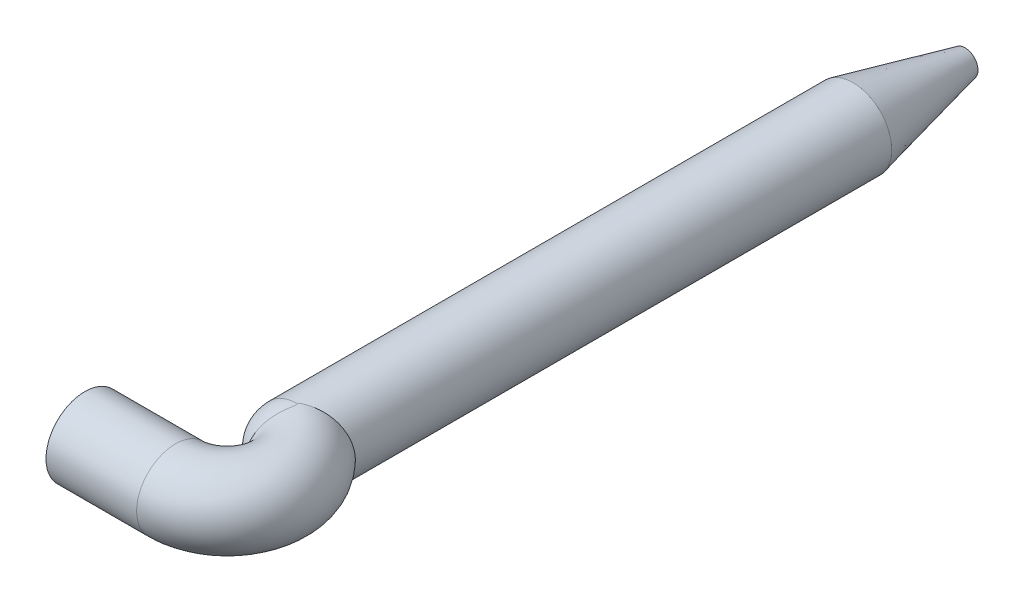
ISO-10303-21;
HEADER;
FILE_DESCRIPTION(('STEP AP214'),'2;1');
FILE_NAME('part.step','',(''),(''),'','','');
FILE_SCHEMA(('AUTOMOTIVE_DESIGN { 1 0 10303 214 1 1 1 1 }'));
ENDSEC;
DATA;
#1=APPLICATION_CONTEXT('core data for automotive mechanical design processes');
#2=APPLICATION_PROTOCOL_DEFINITION('international standard','automotive_design',2000,#1);
#3=PRODUCT_CONTEXT('',#1,'mechanical');
#4=PRODUCT('Part','Part','',(#3));
#5=PRODUCT_RELATED_PRODUCT_CATEGORY('part','',(#4));
#6=PRODUCT_DEFINITION_FORMATION('','',#4);
#7=PRODUCT_DEFINITION_CONTEXT('part definition',#1,'design');
#8=PRODUCT_DEFINITION('design','',#6,#7);
#9=PRODUCT_DEFINITION_SHAPE('','',#8);
#10=(LENGTH_UNIT() NAMED_UNIT(*) SI_UNIT(.MILLI.,.METRE.));
#11=(NAMED_UNIT(*) PLANE_ANGLE_UNIT() SI_UNIT($,.RADIAN.));
#12=(NAMED_UNIT(*) SI_UNIT($,.STERADIAN.) SOLID_ANGLE_UNIT());
#13=UNCERTAINTY_MEASURE_WITH_UNIT(LENGTH_MEASURE(1.E-05),#10,'distance_accuracy_value','');
#14=(GEOMETRIC_REPRESENTATION_CONTEXT(3) GLOBAL_UNCERTAINTY_ASSIGNED_CONTEXT((#13)) GLOBAL_UNIT_ASSIGNED_CONTEXT((#10,
#11,#12)) REPRESENTATION_CONTEXT('',''));
#15=CARTESIAN_POINT('',(0.,0.,0.));
#16=DIRECTION('',(0.,0.,1.));
#17=DIRECTION('',(1.,0.,0.));
#18=AXIS2_PLACEMENT_3D('',#15,#16,#17);
#19=CARTESIAN_POINT('',(-7.,-21.5,21.));
#20=DIRECTION('',(-1.,0.,0.));
#21=DIRECTION('',(0.,0.,1.));
#22=AXIS2_PLACEMENT_3D('',#19,#20,#21);
#23=PLANE('',#22);
#24=CARTESIAN_POINT('',(-7.,-21.5,21.));
#25=DIRECTION('',(-1.,0.,0.));
#26=DIRECTION('',(0.,0.,1.));
#27=AXIS2_PLACEMENT_3D('',#24,#25,#26);
#28=CIRCLE('',#27,3.);
#29=CARTESIAN_POINT('',(-7.,-21.5,24.));
#30=VERTEX_POINT('',#29);
#31=EDGE_CURVE('E143',#30,#30,#28,.F.);
#32=ORIENTED_EDGE('',*,*,#31,.F.);
#33=EDGE_LOOP('',(#32));
#34=FACE_BOUND('',#33,.T.);
#35=ADVANCED_FACE('F36',(#34),#23,.T.);
#36=CARTESIAN_POINT('',(-3.5,-21.5,21.));
#37=DIRECTION('',(-1.,0.,0.));
#38=DIRECTION('',(0.,0.,1.));
#39=AXIS2_PLACEMENT_3D('',#36,#37,#38);
#40=CYLINDRICAL_SURFACE('',#39,3.);
#41=ORIENTED_EDGE('',*,*,#31,.T.);
#42=EDGE_LOOP('',(#41));
#43=FACE_BOUND('',#42,.T.);
#44=CARTESIAN_POINT('',(0.,-21.5,21.));
#45=DIRECTION('',(-1.,0.,0.));
#46=DIRECTION('',(0.,0.,1.));
#47=AXIS2_PLACEMENT_3D('',#44,#45,#46);
#48=CIRCLE('',#47,3.);
#49=CARTESIAN_POINT('',(0.,-21.5,24.));
#50=VERTEX_POINT('',#49);
#51=EDGE_CURVE('E140',#50,#50,#48,.F.);
#52=ORIENTED_EDGE('',*,*,#51,.F.);
#53=EDGE_LOOP('',(#52));
#54=FACE_BOUND('',#53,.T.);
#55=ADVANCED_FACE('F106',(#43,#54),#40,.T.);
#56=CARTESIAN_POINT('',(0.,-21.5,17.));
#57=DIRECTION('',(0.,-1.,0.));
#58=DIRECTION('',(-0.866025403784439,0.,-0.5));
#59=AXIS2_PLACEMENT_3D('',#56,#57,#58);
#60=TOROIDAL_SURFACE('',#59,4.,3.);
#61=ORIENTED_EDGE('',*,*,#51,.T.);
#62=EDGE_LOOP('',(#61));
#63=FACE_BOUND('',#62,.T.);
#64=CARTESIAN_POINT('',(2.03666666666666,-24.4997759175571,13.6));
#65=CARTESIAN_POINT('',(2.03517029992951,-24.4997945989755,13.5973220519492));
#66=CARTESIAN_POINT('',(2.03367057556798,-24.4998121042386,13.5946459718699));
#67=CARTESIAN_POINT('',(2.03066312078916,-24.4998447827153,13.5892952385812));
#68=CARTESIAN_POINT('',(2.0291553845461,-24.4998599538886,13.5866205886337));
#69=CARTESIAN_POINT('',(2.02613190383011,-24.4998879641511,13.5812727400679));
#70=CARTESIAN_POINT('',(2.02461615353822,-24.499900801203,13.5785995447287));
#71=CARTESIAN_POINT('',(2.02157664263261,-24.4999241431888,13.5732546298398));
#72=CARTESIAN_POINT('',(2.02005287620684,-24.4999346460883,13.5705829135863));
#73=CARTESIAN_POINT('',(2.01699733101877,-24.4999533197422,13.5652409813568));
#74=CARTESIAN_POINT('',(2.01546554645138,-24.4999614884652,13.5625707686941));
#75=CARTESIAN_POINT('',(2.01239396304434,-24.4999754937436,13.5572318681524));
#76=CARTESIAN_POINT('',(2.01085415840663,-24.4999813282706,13.5545631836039));
#77=CARTESIAN_POINT('',(2.00776653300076,-24.4999906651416,13.5492273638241));
#78=CARTESIAN_POINT('',(2.00621870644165,-24.49999416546,13.5465602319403));
#79=CARTESIAN_POINT('',(2.00311503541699,-24.4999988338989,13.5412275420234));
#80=CARTESIAN_POINT('',(2.00155918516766,-24.4999999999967,13.5385619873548));
#81=CARTESIAN_POINT('',(2.,-24.5,13.5358983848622));
#82=B_SPLINE_CURVE_WITH_KNOTS('',3,(#64,#65,#66,#67,#68,#69,#70,#71,#72,#73,#74,#75,#76,#77,#78,
#79,#80,#81),.UNSPECIFIED.,.F.,.F.,(4,2,2,2,2,2,2,2,4),(0.,0.00920313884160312,
0.0184142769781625,0.0276334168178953,0.0368605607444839,0.046095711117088,0.0553388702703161,
0.0645900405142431,0.0738492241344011),.UNSPECIFIED.);
#83=CARTESIAN_POINT('',(2.,-24.5,13.5358983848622));
#84=VERTEX_POINT('',#83);
#85=CARTESIAN_POINT('',(2.03666666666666,-24.4997759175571,13.6));
#86=VERTEX_POINT('',#85);
#87=EDGE_CURVE('E82',#84,#86,#82,.F.);
#88=ORIENTED_EDGE('',*,*,#87,.F.);
#89=CARTESIAN_POINT('',(2.,-24.5,13.5358983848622));
#90=CARTESIAN_POINT('',(2.05506591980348,-24.5000014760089,13.5041037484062));
#91=CARTESIAN_POINT('',(2.11032116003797,-24.4984838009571,13.4726310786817));
#92=CARTESIAN_POINT('',(2.2220529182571,-24.4923009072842,13.4098082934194));
#93=CARTESIAN_POINT('',(2.27853338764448,-24.4875790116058,13.3784707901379));
#94=CARTESIAN_POINT('',(2.39252571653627,-24.4747632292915,13.316018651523));
#95=CARTESIAN_POINT('',(2.45003847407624,-24.4666122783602,13.2849173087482));
#96=CARTESIAN_POINT('',(2.5658738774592,-24.4467235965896,13.2230410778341));
#97=CARTESIAN_POINT('',(2.62419418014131,-24.4349287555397,13.1922801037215));
#98=CARTESIAN_POINT('',(2.74139235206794,-24.4075481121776,13.1311926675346));
#99=CARTESIAN_POINT('',(2.8002645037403,-24.3919054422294,13.1008807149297));
#100=CARTESIAN_POINT('',(2.91829039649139,-24.3566361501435,13.0407997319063));
#101=CARTESIAN_POINT('',(2.97743504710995,-24.3369531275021,13.0110457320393));
#102=CARTESIAN_POINT('',(3.06580453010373,-24.3044306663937,12.9670698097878));
#103=CARTESIAN_POINT('',(3.09536125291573,-24.2930205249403,12.9524434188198));
#104=CARTESIAN_POINT('',(3.1544239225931,-24.2691343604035,12.9233716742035));
#105=CARTESIAN_POINT('',(3.18392806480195,-24.2566514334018,12.9089283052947));
#106=CARTESIAN_POINT('',(3.24284080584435,-24.2306016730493,12.8802381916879));
#107=CARTESIAN_POINT('',(3.27224736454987,-24.2170279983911,12.8659934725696));
#108=CARTESIAN_POINT('',(3.33092004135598,-24.1887797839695,12.837715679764));
#109=CARTESIAN_POINT('',(3.36018389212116,-24.1740984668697,12.8236846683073));
#110=CARTESIAN_POINT('',(3.41852415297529,-24.1436197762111,12.795849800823));
#111=CARTESIAN_POINT('',(3.44759806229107,-24.1278156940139,12.7820480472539));
#112=CARTESIAN_POINT('',(3.50550994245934,-24.0950780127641,12.754687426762));
#113=CARTESIAN_POINT('',(3.53434517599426,-24.0781377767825,12.7411307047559));
#114=CARTESIAN_POINT('',(3.59172962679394,-24.0431162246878,12.7142761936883));
#115=CARTESIAN_POINT('',(3.62027586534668,-24.0250283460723,12.7009805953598));
#116=CARTESIAN_POINT('',(3.67703078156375,-23.9877019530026,12.6746646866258));
#117=CARTESIAN_POINT('',(3.7052362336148,-23.9684569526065,12.6616466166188));
#118=CARTESIAN_POINT('',(3.76125664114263,-23.9288089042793,12.6359024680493));
#119=CARTESIAN_POINT('',(3.78906811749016,-23.9083994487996,12.6231786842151));
#120=CARTESIAN_POINT('',(3.84424632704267,-23.8664173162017,12.5980401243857));
#121=CARTESIAN_POINT('',(3.87160931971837,-23.8448383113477,12.585627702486));
#122=CARTESIAN_POINT('',(3.92583515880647,-23.8005143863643,12.5611294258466));
#123=CARTESIAN_POINT('',(3.95269399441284,-23.7777632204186,12.5490459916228));
#124=CARTESIAN_POINT('',(4.00585486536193,-23.7310944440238,12.5252230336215));
#125=CARTESIAN_POINT('',(4.03215260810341,-23.7071706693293,12.5134859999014));
#126=CARTESIAN_POINT('',(4.08150990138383,-23.6606344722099,12.4915426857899));
#127=CARTESIAN_POINT('',(4.10463917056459,-23.6381144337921,12.4812971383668));
#128=CARTESIAN_POINT('',(4.15031983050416,-23.5921744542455,12.4611306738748));
#129=CARTESIAN_POINT('',(4.17286880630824,-23.5687515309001,12.4512110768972));
#130=CARTESIAN_POINT('',(4.21734760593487,-23.5210149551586,12.4317063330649));
#131=CARTESIAN_POINT('',(4.23927486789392,-23.4966983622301,12.4221225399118));
#132=CARTESIAN_POINT('',(4.2824694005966,-23.4471853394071,12.403299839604));
#133=CARTESIAN_POINT('',(4.30373395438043,-23.4219860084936,12.394062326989));
#134=CARTESIAN_POINT('',(4.34556210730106,-23.3707201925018,12.3759427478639));
#135=CARTESIAN_POINT('',(4.36612282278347,-23.3446508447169,12.3670621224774));
#136=CARTESIAN_POINT('',(4.40650247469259,-23.2916595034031,12.3496671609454));
#137=CARTESIAN_POINT('',(4.4263183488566,-23.2647346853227,12.3411543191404));
#138=CARTESIAN_POINT('',(4.46516767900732,-23.2100487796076,12.324506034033));
#139=CARTESIAN_POINT('',(4.48419788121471,-23.1822849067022,12.3163721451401));
#140=CARTESIAN_POINT('',(4.52143552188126,-23.125939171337,12.3004931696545));
#141=CARTESIAN_POINT('',(4.53963950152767,-23.0973545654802,12.2927497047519));
#142=CARTESIAN_POINT('',(4.57518474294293,-23.0393875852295,12.2776632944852));
#143=CARTESIAN_POINT('',(4.59252232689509,-23.0100025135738,12.2703220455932));
#144=CARTESIAN_POINT('',(4.62629531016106,-22.9504567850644,12.2560521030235));
#145=CARTESIAN_POINT('',(4.64272679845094,-22.9202934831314,12.2491251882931));
#146=CARTESIAN_POINT('',(4.67464874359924,-22.8592155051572,12.2356963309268));
#147=CARTESIAN_POINT('',(4.69013504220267,-22.8282982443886,12.2291962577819));
#148=CARTESIAN_POINT('',(4.72012838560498,-22.7657384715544,12.2166337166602));
#149=CARTESIAN_POINT('',(4.73463101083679,-22.7340934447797,12.2105732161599));
#150=CARTESIAN_POINT('',(4.76216252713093,-22.6711523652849,12.1990940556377));
#151=CARTESIAN_POINT('',(4.7752215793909,-22.6398719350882,12.1936620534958));
#152=CARTESIAN_POINT('',(4.80030388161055,-22.5768065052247,12.1832488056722));
#153=CARTESIAN_POINT('',(4.81232662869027,-22.545021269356,12.1782677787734));
#154=CARTESIAN_POINT('',(4.83531264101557,-22.4809799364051,12.168759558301));
#155=CARTESIAN_POINT('',(4.84627523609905,-22.4487235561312,12.1642326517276));
#156=CARTESIAN_POINT('',(4.86711884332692,-22.3837745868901,12.1556360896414));
#157=CARTESIAN_POINT('',(4.87699900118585,-22.3510816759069,12.1515667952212));
#158=CARTESIAN_POINT('',(4.89565707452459,-22.2852952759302,12.1438890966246));
#159=CARTESIAN_POINT('',(4.90443393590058,-22.2522014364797,12.1402811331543));
#160=CARTESIAN_POINT('',(4.92086630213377,-22.1856497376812,12.1335300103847));
#161=CARTESIAN_POINT('',(4.9285205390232,-22.1521915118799,12.1303873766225));
#162=CARTESIAN_POINT('',(4.94269012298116,-22.0849484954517,12.1245711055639));
#163=CARTESIAN_POINT('',(4.94920397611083,-22.0511633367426,12.1218980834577));
#164=CARTESIAN_POINT('',(4.96107689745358,-21.9833047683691,12.117025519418));
#165=CARTESIAN_POINT('',(4.96643423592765,-21.9492310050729,12.1148266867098));
#166=CARTESIAN_POINT('',(4.97597989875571,-21.8808343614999,12.1109072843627));
#167=CARTESIAN_POINT('',(4.98016625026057,-21.8465111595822,12.1091875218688));
#168=CARTESIAN_POINT('',(4.98735748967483,-21.7776555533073,12.106231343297));
#169=CARTESIAN_POINT('',(4.99036015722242,-21.7431228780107,12.1049958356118));
#170=CARTESIAN_POINT('',(4.99517314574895,-21.6738889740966,12.1030135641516));
#171=CARTESIAN_POINT('',(4.99698099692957,-21.6391875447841,12.1022678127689));
#172=CARTESIAN_POINT('',(4.99939603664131,-21.5696574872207,12.1012707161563));
#173=CARTESIAN_POINT('',(5.00000050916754,-21.5348287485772,12.1010204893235));
#174=CARTESIAN_POINT('',(4.99999999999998,-21.5,12.1010205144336));
#175=B_SPLINE_CURVE_WITH_KNOTS('',3,(#89,#90,#91,#92,#93,#94,#95,#96,#97,#98,#99,#100,#101,#102,
#103,#104,#105,#106,#107,#108,#109,#110,#111,#112,#113,#114,#115,#116,#117,#118,#119,#120,#121,
#122,#123,#124,#125,#126,#127,#128,#129,#130,#131,#132,#133,#134,#135,#136,#137,#138,#139,#140,
#141,#142,#143,#144,#145,#146,#147,#148,#149,#150,#151,#152,#153,#154,#155,#156,#157,#158,#159,
#160,#161,#162,#163,#164,#165,#166,#167,#168,#169,#170,#171,#172,#173,#174),.UNSPECIFIED.,.F.,
.F.,(4,2,2,2,2,2,2,2,2,2,2,2,2,2,2,2,2,2,2,2,2,2,2,2,2,2,2,2,2,2,2,2,2,2,2,2,2,2,2,2,2,2,4),(0.,
0.190742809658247,0.384950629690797,0.582526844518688,0.783371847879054,0.987385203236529,
1.19446809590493,1.29914267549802,1.40455019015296,1.51068000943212,1.6175221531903,
1.72506739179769,1.83330734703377,1.94223459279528,2.05184275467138,2.16212660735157,
2.27308216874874,2.38470678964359,2.49699923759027,2.59858751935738,2.7005462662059,
2.80287736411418,2.90558394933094,3.00867043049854,3.11214250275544,3.21600715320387,
3.32027265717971,3.42494856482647,3.53004567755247,3.63557601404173,3.74155276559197,
3.84451906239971,3.94753504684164,4.05061573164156,4.15377719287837,4.25703647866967,
4.36041150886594,4.46392096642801,4.56758418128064,4.67142100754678,4.77545169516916,
4.87969675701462,4.9841768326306),.UNSPECIFIED.);
#176=CARTESIAN_POINT('',(4.99999999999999,-21.5,12.1010205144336));
#177=VERTEX_POINT('',#176);
#178=EDGE_CURVE('E185',#177,#84,#175,.F.);
#179=ORIENTED_EDGE('',*,*,#178,.F.);
#180=CARTESIAN_POINT('',(4.99999999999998,-21.5,12.1010205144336));
#181=CARTESIAN_POINT('',(5.00000050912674,-21.4651738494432,12.1010204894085));
#182=CARTESIAN_POINT('',(4.99939609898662,-21.4303477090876,12.1012706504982));
#183=CARTESIAN_POINT('',(4.99698130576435,-21.3608223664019,12.1022675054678));
#184=CARTESIAN_POINT('',(4.99517362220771,-21.3261230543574,12.103013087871));
#185=CARTESIAN_POINT('',(4.99036105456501,-21.2568928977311,12.1049949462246));
#186=CARTESIAN_POINT('',(4.98735862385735,-21.222361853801,12.1062302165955));
#187=CARTESIAN_POINT('',(4.98016790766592,-21.1535090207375,12.1091858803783));
#188=CARTESIAN_POINT('',(4.97598182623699,-21.1191869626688,12.1109053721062));
#189=CARTESIAN_POINT('',(4.96643671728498,-21.0507921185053,12.114824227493));
#190=CARTESIAN_POINT('',(4.96107964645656,-21.0167190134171,12.1170227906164));
#191=CARTESIAN_POINT('',(4.94920723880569,-20.9488612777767,12.1218948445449));
#192=CARTESIAN_POINT('',(4.9426936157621,-20.9150762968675,12.1245676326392));
#193=CARTESIAN_POINT('',(4.92852443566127,-20.8478331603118,12.1303834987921));
#194=CARTESIAN_POINT('',(4.92087035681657,-20.8143746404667,12.133525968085));
#195=CARTESIAN_POINT('',(4.9044382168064,-20.7478218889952,12.140276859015));
#196=CARTESIAN_POINT('',(4.89566140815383,-20.7147272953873,12.1438847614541));
#197=CARTESIAN_POINT('',(4.87700331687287,-20.6489389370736,12.1515624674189));
#198=CARTESIAN_POINT('',(4.86712307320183,-20.6162448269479,12.1556318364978));
#199=CARTESIAN_POINT('',(4.84627914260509,-20.5512930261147,12.1642287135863));
#200=CARTESIAN_POINT('',(4.83531629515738,-20.5190350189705,12.168755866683));
#201=CARTESIAN_POINT('',(4.81232958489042,-20.4549900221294,12.1782647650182));
#202=CARTESIAN_POINT('',(4.80030637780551,-20.4232027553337,12.1832462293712));
#203=CARTESIAN_POINT('',(4.77522297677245,-20.3601328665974,12.1936606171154));
#204=CARTESIAN_POINT('',(4.76216327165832,-20.3288500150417,12.1990933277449));
#205=CARTESIAN_POINT('',(4.73463329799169,-20.2659110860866,12.2105726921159));
#206=CARTESIAN_POINT('',(4.72013309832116,-20.234270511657,12.2166325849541));
#207=CARTESIAN_POINT('',(4.69014434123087,-20.1717186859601,12.2291937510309));
#208=CARTESIAN_POINT('',(4.67466017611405,-20.1408049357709,12.2356930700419));
#209=CARTESIAN_POINT('',(4.64274221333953,-20.0797330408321,12.2491203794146));
#210=CARTESIAN_POINT('',(4.62631254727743,-20.0495723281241,12.2560465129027));
#211=CARTESIAN_POINT('',(4.59254285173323,-19.9900308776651,12.2703149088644));
#212=CARTESIAN_POINT('',(4.57520670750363,-19.9606475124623,12.2776554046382));
#213=CARTESIAN_POINT('',(4.53966393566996,-19.9026830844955,12.2927403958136));
#214=CARTESIAN_POINT('',(4.52146096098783,-19.8740993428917,12.3004832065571));
#215=CARTESIAN_POINT('',(4.48422486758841,-19.8177545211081,12.3163610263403));
#216=CARTESIAN_POINT('',(4.46519518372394,-19.7899907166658,12.3244944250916));
#217=CARTESIAN_POINT('',(4.42634638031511,-19.7353041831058,12.3411419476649));
#218=CARTESIAN_POINT('',(4.40653049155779,-19.7083786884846,12.3496545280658));
#219=CARTESIAN_POINT('',(4.36615025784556,-19.6553852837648,12.3670492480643));
#220=CARTESIAN_POINT('',(4.3455889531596,-19.6293145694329,12.3759299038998));
#221=CARTESIAN_POINT('',(4.30375903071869,-19.5780453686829,12.3940498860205));
#222=CARTESIAN_POINT('',(4.28249327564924,-19.552844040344,12.4032877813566));
#223=CARTESIAN_POINT('',(4.23929571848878,-19.5033264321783,12.4221116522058));
#224=CARTESIAN_POINT('',(4.21736661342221,-19.4790072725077,12.4316962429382));
#225=CARTESIAN_POINT('',(4.17288346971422,-19.4312650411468,12.4512030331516));
#226=CARTESIAN_POINT('',(4.15033197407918,-19.4078390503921,12.4611238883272));
#227=CARTESIAN_POINT('',(4.10464562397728,-19.3618924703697,12.4812934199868));
#228=CARTESIAN_POINT('',(4.08151316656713,-19.3393689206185,12.4915407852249));
#229=CARTESIAN_POINT('',(4.03215368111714,-19.2928299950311,12.5134860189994));
#230=CARTESIAN_POINT('',(4.00585705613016,-19.2689068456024,12.5252230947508));
#231=CARTESIAN_POINT('',(3.95269831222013,-19.2222392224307,12.5490460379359));
#232=CARTESIAN_POINT('',(3.92584048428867,-19.1994885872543,12.5611294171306));
#233=CARTESIAN_POINT('',(3.87161658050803,-19.1551656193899,12.5856275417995));
#234=CARTESIAN_POINT('',(3.84425451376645,-19.1335870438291,12.5980398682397));
#235=CARTESIAN_POINT('',(3.78907806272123,-19.0916056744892,12.6231781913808));
#236=CARTESIAN_POINT('',(3.76126741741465,-19.0711965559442,12.6359018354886));
#237=CARTESIAN_POINT('',(3.7052485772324,-19.0315490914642,12.6616456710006));
#238=CARTESIAN_POINT('',(3.67704386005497,-19.0123043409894,12.6746635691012));
#239=CARTESIAN_POINT('',(3.62029031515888,-18.9749783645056,12.7009791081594));
#240=CARTESIAN_POINT('',(3.591744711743,-18.9568906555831,12.7142745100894));
#241=CARTESIAN_POINT('',(3.5343614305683,-18.9218693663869,12.7411286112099));
#242=CARTESIAN_POINT('',(3.50552673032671,-18.9049292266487,12.7546851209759));
#243=CARTESIAN_POINT('',(3.44761581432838,-18.8721916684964,12.7820453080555));
#244=CARTESIAN_POINT('',(3.41854233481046,-18.8563876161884,12.7958468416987));
#245=CARTESIAN_POINT('',(3.36020283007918,-18.8259089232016,12.8236812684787));
#246=CARTESIAN_POINT('',(3.33093930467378,-18.8112275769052,12.8377120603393));
#247=CARTESIAN_POINT('',(3.27226717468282,-18.7829792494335,12.8659894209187));
#248=CARTESIAN_POINT('',(3.24286083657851,-18.7694054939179,12.8802339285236));
#249=CARTESIAN_POINT('',(3.1839484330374,-18.7433555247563,12.9089236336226));
#250=CARTESIAN_POINT('',(3.15444440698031,-18.7308724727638,12.9233668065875));
#251=CARTESIAN_POINT('',(3.09538186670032,-18.7069860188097,12.9524381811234));
#252=CARTESIAN_POINT('',(3.06582515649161,-18.6955757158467,12.9670643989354));
#253=CARTESIAN_POINT('',(2.97745542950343,-18.6630526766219,13.0110399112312));
#254=CARTESIAN_POINT('',(2.91831049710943,-18.6433692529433,13.0407936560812));
#255=CARTESIAN_POINT('',(2.80028365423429,-18.6080990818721,13.1008742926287));
#256=CARTESIAN_POINT('',(2.74141083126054,-18.5924559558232,13.1311861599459));
#257=CARTESIAN_POINT('',(2.62421095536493,-18.5650743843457,13.1922736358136));
#258=CARTESIAN_POINT('',(2.56588961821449,-18.5532790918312,13.2230347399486));
#259=CARTESIAN_POINT('',(2.45005181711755,-18.5333895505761,13.2849114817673));
#260=CARTESIAN_POINT('',(2.39253769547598,-18.5252382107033,13.316013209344));
#261=CARTESIAN_POINT('',(2.27854234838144,-18.5124217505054,13.3784664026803));
#262=CARTESIAN_POINT('',(2.22206022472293,-18.507699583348,13.4098045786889));
#263=CARTESIAN_POINT('',(2.1103249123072,-18.5015163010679,13.4726290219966));
#264=CARTESIAN_POINT('',(2.0550677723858,-18.4999985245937,13.5041026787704));
#265=CARTESIAN_POINT('',(2.,-18.5,13.5358983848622));
#266=B_SPLINE_CURVE_WITH_KNOTS('',3,(#180,#181,#182,#183,#184,#185,#186,#187,#188,#189,#190,
#191,#192,#193,#194,#195,#196,#197,#198,#199,#200,#201,#202,#203,#204,#205,#206,#207,#208,#209,
#210,#211,#212,#213,#214,#215,#216,#217,#218,#219,#220,#221,#222,#223,#224,#225,#226,#227,#228,
#229,#230,#231,#232,#233,#234,#235,#236,#237,#238,#239,#240,#241,#242,#243,#244,#245,#246,#247,
#248,#249,#250,#251,#252,#253,#254,#255,#256,#257,#258,#259,#260,#261,#262,#263,#264,#265),
.UNSPECIFIED.,.F.,.F.,(4,2,2,2,2,2,2,2,2,2,2,2,2,2,2,2,2,2,2,2,2,2,2,2,2,2,2,2,2,2,2,2,2,2,2,2,
2,2,2,2,2,2,4),(0.,0.10447228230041,0.208710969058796,0.312736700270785,0.416569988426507,
0.520231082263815,0.623739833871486,0.727115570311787,0.830376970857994,0.933541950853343,
1.03662755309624,1.13964984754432,1.24262384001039,1.34858533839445,1.45410319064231,
1.55919059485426,1.66385957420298,1.76812093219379,1.871984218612,1.97545770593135,
2.07854837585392,2.18126191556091,2.28360272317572,2.38557392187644,2.48717738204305,
2.59946631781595,2.71108773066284,2.82204039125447,2.93232165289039,3.04192753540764,
3.15085281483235,3.25909111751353,3.36663501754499,3.47347613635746,3.57960524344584,
3.68501235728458,3.7896868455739,3.99677047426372,4.20078577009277,4.40163388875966,
4.59921435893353,4.79342753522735,4.98417675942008),.UNSPECIFIED.);
#267=CARTESIAN_POINT('',(2.,-18.5,13.5358983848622));
#268=VERTEX_POINT('',#267);
#269=EDGE_CURVE('E53',#268,#177,#266,.F.);
#270=ORIENTED_EDGE('',*,*,#269,.F.);
#271=CARTESIAN_POINT('',(2.,-18.5,13.5358983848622));
#272=CARTESIAN_POINT('',(2.00155918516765,-18.5000000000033,13.5385619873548));
#273=CARTESIAN_POINT('',(2.00311503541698,-18.5000011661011,13.5412275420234));
#274=CARTESIAN_POINT('',(2.00621870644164,-18.50000583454,13.5465602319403));
#275=CARTESIAN_POINT('',(2.00776653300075,-18.5000093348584,13.5492273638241));
#276=CARTESIAN_POINT('',(2.01085415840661,-18.5000186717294,13.5545631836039));
#277=CARTESIAN_POINT('',(2.01239396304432,-18.5000245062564,13.5572318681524));
#278=CARTESIAN_POINT('',(2.01546554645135,-18.5000385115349,13.5625707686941));
#279=CARTESIAN_POINT('',(2.01699733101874,-18.5000466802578,13.5652409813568));
#280=CARTESIAN_POINT('',(2.02005287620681,-18.5000653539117,13.5705829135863));
#281=CARTESIAN_POINT('',(2.02157664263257,-18.5000758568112,13.5732546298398));
#282=CARTESIAN_POINT('',(2.02461615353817,-18.500099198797,13.5785995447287));
#283=CARTESIAN_POINT('',(2.02613190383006,-18.5001120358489,13.5812727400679));
#284=CARTESIAN_POINT('',(2.02915538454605,-18.5001400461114,13.5866205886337));
#285=CARTESIAN_POINT('',(2.0306631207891,-18.5001552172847,13.5892952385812));
#286=CARTESIAN_POINT('',(2.03367057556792,-18.5001878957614,13.5946459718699));
#287=CARTESIAN_POINT('',(2.03517029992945,-18.5002054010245,13.5973220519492));
#288=CARTESIAN_POINT('',(2.03666666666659,-18.5002240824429,13.6));
#289=B_SPLINE_CURVE_WITH_KNOTS('',3,(#271,#272,#273,#274,#275,#276,#277,#278,#279,#280,#281,
#282,#283,#284,#285,#286,#287,#288),.UNSPECIFIED.,.F.,.F.,(4,2,2,2,2,2,2,2,4),(0.,
0.00925918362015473,0.0185103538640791,0.0277535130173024,0.0369886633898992,0.0462158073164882,
0.0554349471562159,0.0646460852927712,0.073849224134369),.UNSPECIFIED.);
#290=CARTESIAN_POINT('',(2.03666666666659,-18.5002240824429,13.6));
#291=VERTEX_POINT('',#290);
#292=EDGE_CURVE('E87',#291,#268,#289,.F.);
#293=ORIENTED_EDGE('',*,*,#292,.F.);
#294=CARTESIAN_POINT('',(0.732263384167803,-21.4999999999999,16.3189784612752));
#295=CARTESIAN_POINT('',(0.7322637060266,-21.4677858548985,16.31897883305));
#296=CARTESIAN_POINT('',(0.732580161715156,-21.4355717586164,16.3185536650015));
#297=CARTESIAN_POINT('',(0.733841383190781,-21.3710823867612,16.3168485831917));
#298=CARTESIAN_POINT('',(0.734788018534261,-21.3388072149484,16.3155661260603));
#299=CARTESIAN_POINT('',(0.737310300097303,-21.2742058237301,16.3121363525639));
#300=CARTESIAN_POINT('',(0.738888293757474,-21.2418798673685,16.3099858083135));
#301=CARTESIAN_POINT('',(0.742674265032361,-21.1771879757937,16.3048078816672));
#302=CARTESIAN_POINT('',(0.744885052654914,-21.1448225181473,16.3017765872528));
#303=CARTESIAN_POINT('',(0.74993828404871,-21.0800639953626,16.2948231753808));
#304=CARTESIAN_POINT('',(0.752783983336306,-21.0476716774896,16.2908964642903));
#305=CARTESIAN_POINT('',(0.759109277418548,-20.9828734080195,16.2821363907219));
#306=CARTESIAN_POINT('',(0.762592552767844,-20.9504685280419,16.2772977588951));
#307=CARTESIAN_POINT('',(0.770195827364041,-20.8856610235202,16.2666962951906));
#308=CARTESIAN_POINT('',(0.774319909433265,-20.8532598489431,16.2609275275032));
#309=CARTESIAN_POINT('',(0.783208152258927,-20.7884778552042,16.2484466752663));
#310=CARTESIAN_POINT('',(0.787976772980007,-20.7560989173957,16.2417280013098));
#311=CARTESIAN_POINT('',(0.798158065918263,-20.6913820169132,16.2273269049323));
#312=CARTESIAN_POINT('',(0.803575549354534,-20.6590464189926,16.2196372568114));
#313=CARTESIAN_POINT('',(0.815058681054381,-20.5944395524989,16.2032724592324));
#314=CARTESIAN_POINT('',(0.821129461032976,-20.5621711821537,16.1945894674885));
#315=CARTESIAN_POINT('',(0.833925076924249,-20.4977253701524,16.1762160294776));
#316=CARTESIAN_POINT('',(0.840655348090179,-20.4655514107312,16.1665171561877));
#317=CARTESIAN_POINT('',(0.854771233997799,-20.4013235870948,16.1460867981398));
#318=CARTESIAN_POINT('',(0.862162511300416,-20.3692738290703,16.1353463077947));
#319=CARTESIAN_POINT('',(0.876424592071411,-20.3102789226,16.1145607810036));
#320=CARTESIAN_POINT('',(0.883214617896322,-20.2832696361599,16.1046419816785));
#321=CARTESIAN_POINT('',(0.897359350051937,-20.2290893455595,16.0839240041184));
#322=CARTESIAN_POINT('',(0.904722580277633,-20.2019257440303,16.0731112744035));
#323=CARTESIAN_POINT('',(0.920014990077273,-20.1474707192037,16.0505595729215));
#324=CARTESIAN_POINT('',(0.927952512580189,-20.1201874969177,16.0388064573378));
#325=CARTESIAN_POINT('',(0.944399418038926,-20.0655314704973,16.0143302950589));
#326=CARTESIAN_POINT('',(0.952917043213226,-20.0381677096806,16.0015925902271));
#327=CARTESIAN_POINT('',(0.970528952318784,-19.9833933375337,15.9751034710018));
#328=CARTESIAN_POINT('',(0.979631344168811,-19.9559926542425,15.9613369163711));
#329=CARTESIAN_POINT('',(0.998418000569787,-19.9011918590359,15.9327473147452));
#330=CARTESIAN_POINT('',(1.0081102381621,-19.8738026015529,15.9179086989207));
#331=CARTESIAN_POINT('',(1.02808173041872,-19.8190769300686,15.8871333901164));
#332=CARTESIAN_POINT('',(1.0383688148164,-19.7917523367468,15.8711807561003));
#333=CARTESIAN_POINT('',(1.05953514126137,-19.7372132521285,15.8381375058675));
#334=CARTESIAN_POINT('',(1.07042206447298,-19.7100115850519,15.8210306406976));
#335=CARTESIAN_POINT('',(1.09279311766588,-19.6557807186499,15.7856411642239));
#336=CARTESIAN_POINT('',(1.10428477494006,-19.6287653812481,15.767342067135));
#337=CARTESIAN_POINT('',(1.12787019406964,-19.5749746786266,15.729532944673));
#338=CARTESIAN_POINT('',(1.13997132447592,-19.548214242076,15.7100062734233));
#339=CARTESIAN_POINT('',(1.16478040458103,-19.4950061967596,15.6697101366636));
#340=CARTESIAN_POINT('',(1.17749556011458,-19.4685746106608,15.6489239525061));
#341=CARTESIAN_POINT('',(1.20353702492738,-19.4161018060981,15.6060799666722));
#342=CARTESIAN_POINT('',(1.21687037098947,-19.3900777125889,15.5840054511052));
#343=CARTESIAN_POINT('',(1.24086540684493,-19.3447185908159,15.5440380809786));
#344=CARTESIAN_POINT('',(1.25145536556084,-19.3251927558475,15.5263181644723));
#345=CARTESIAN_POINT('',(1.2734051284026,-19.2856802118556,15.4893770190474));
#346=CARTESIAN_POINT('',(1.28477539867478,-19.2657265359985,15.47012664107));
#347=CARTESIAN_POINT('',(1.30829111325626,-19.2254691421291,15.430038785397));
#348=CARTESIAN_POINT('',(1.32044609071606,-19.2052013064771,15.409170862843));
#349=CARTESIAN_POINT('',(1.34553784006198,-19.1644382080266,15.3657648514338));
#350=CARTESIAN_POINT('',(1.35848341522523,-19.1439818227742,15.3431953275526));
#351=CARTESIAN_POINT('',(1.38515753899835,-19.1029765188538,15.2963045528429));
#352=CARTESIAN_POINT('',(1.39889401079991,-19.0824696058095,15.2719510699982));
#353=CARTESIAN_POINT('',(1.4271699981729,-19.0415126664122,15.2214252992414));
#354=CARTESIAN_POINT('',(1.44171754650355,-19.0211079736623,15.1952207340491));
#355=CARTESIAN_POINT('',(1.46978919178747,-18.9829179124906,15.1441156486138));
#356=CARTESIAN_POINT('',(1.48330545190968,-18.965052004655,15.1192709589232));
#357=CARTESIAN_POINT('',(1.51039760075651,-18.9302250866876,15.068900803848));
#358=CARTESIAN_POINT('',(1.5239735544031,-18.9132659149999,15.0433741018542));
#359=CARTESIAN_POINT('',(1.55119693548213,-18.8802825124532,14.9916836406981));
#360=CARTESIAN_POINT('',(1.56484444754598,-18.8642600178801,14.9655188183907));
#361=CARTESIAN_POINT('',(1.59220813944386,-18.8331770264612,14.9125897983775));
#362=CARTESIAN_POINT('',(1.60592439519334,-18.8181181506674,14.8858246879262));
#363=CARTESIAN_POINT('',(1.63341081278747,-18.7889870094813,14.8317285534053));
#364=CARTESIAN_POINT('',(1.64718102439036,-18.7749162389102,14.8043967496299));
#365=CARTESIAN_POINT('',(1.67482295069,-18.7477890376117,14.7492310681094));
#366=CARTESIAN_POINT('',(1.68869477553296,-18.7347339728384,14.7213965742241));
#367=CARTESIAN_POINT('',(1.71800503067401,-18.7081437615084,14.6618129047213));
#368=CARTESIAN_POINT('',(1.73342996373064,-18.6947416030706,14.6299975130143));
#369=CARTESIAN_POINT('',(1.76320938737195,-18.6698115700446,14.5670928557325));
#370=CARTESIAN_POINT('',(1.777580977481,-18.6582268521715,14.5360342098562));
#371=CARTESIAN_POINT('',(1.80530411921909,-18.6367832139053,14.4747965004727));
#372=CARTESIAN_POINT('',(1.81867195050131,-18.6268689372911,14.4446441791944));
#373=CARTESIAN_POINT('',(1.84436594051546,-18.608612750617,14.3853214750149));
#374=CARTESIAN_POINT('',(1.85671100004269,-18.6002174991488,14.3561757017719));
#375=CARTESIAN_POINT('',(1.88035792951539,-18.5848492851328,14.2989606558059));
#376=CARTESIAN_POINT('',(1.89168071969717,-18.5778251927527,14.2709137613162));
#377=CARTESIAN_POINT('',(1.91327463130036,-18.5650521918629,14.2159720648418));
#378=CARTESIAN_POINT('',(1.92356942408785,-18.5592546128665,14.1890979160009));
#379=CARTESIAN_POINT('',(1.94179217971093,-18.5494993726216,14.1401157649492));
#380=CARTESIAN_POINT('',(1.94980017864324,-18.5454009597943,14.118065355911));
#381=CARTESIAN_POINT('',(1.9673025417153,-18.5368281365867,14.0684173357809));
#382=CARTESIAN_POINT('',(1.9766929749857,-18.532499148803,14.0407572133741));
#383=CARTESIAN_POINT('',(1.98982880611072,-18.526765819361,13.9999543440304));
#384=CARTESIAN_POINT('',(1.9939061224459,-18.5250360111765,13.9869631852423));
#385=CARTESIAN_POINT('',(2.00164969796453,-18.5218375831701,13.9615464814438));
#386=CARTESIAN_POINT('',(2.00532631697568,-18.5203602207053,13.94912519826));
#387=CARTESIAN_POINT('',(2.01467928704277,-18.5166950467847,13.9164242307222));
#388=CARTESIAN_POINT('',(2.02017219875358,-18.5146390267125,13.8960765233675));
#389=CARTESIAN_POINT('',(2.0298641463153,-18.5111288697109,13.8571426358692));
#390=CARTESIAN_POINT('',(2.0341371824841,-18.5096355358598,13.8385787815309));
#391=CARTESIAN_POINT('',(2.03971270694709,-18.5077028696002,13.8113243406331));
#392=CARTESIAN_POINT('',(2.04137313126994,-18.5071298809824,13.8027162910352));
#393=CARTESIAN_POINT('',(2.04437424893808,-18.5060857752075,13.7859491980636));
#394=CARTESIAN_POINT('',(2.04572782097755,-18.5056106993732,13.7777927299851));
#395=CARTESIAN_POINT('',(2.04811424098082,-18.504749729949,13.7619302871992));
#396=CARTESIAN_POINT('',(2.04916147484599,-18.5043601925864,13.7542266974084));
#397=CARTESIAN_POINT('',(2.05093347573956,-18.5036584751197,13.7392710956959));
#398=CARTESIAN_POINT('',(2.05167439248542,-18.5033429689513,13.7320211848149));
#399=CARTESIAN_POINT('',(2.05283191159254,-18.5027783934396,13.7179738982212));
#400=CARTESIAN_POINT('',(2.05326666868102,-18.5025263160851,13.7111781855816));
#401=CARTESIAN_POINT('',(2.05380964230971,-18.5020785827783,13.6980405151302));
#402=CARTESIAN_POINT('',(2.05393828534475,-18.501880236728,13.6916995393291));
#403=CARTESIAN_POINT('',(2.05386674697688,-18.5015308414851,13.6794716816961));
#404=CARTESIAN_POINT('',(2.05368948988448,-18.5013774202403,13.6735848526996));
#405=CARTESIAN_POINT('',(2.05316462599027,-18.5011727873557,13.6649353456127));
#406=CARTESIAN_POINT('',(2.05295638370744,-18.5011103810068,13.6621642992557));
#407=CARTESIAN_POINT('',(2.05245970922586,-18.5009941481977,13.6567364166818));
#408=CARTESIAN_POINT('',(2.05217466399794,-18.5009400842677,13.6540792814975));
#409=CARTESIAN_POINT('',(2.05152429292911,-18.5008396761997,13.6488794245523));
#410=CARTESIAN_POINT('',(2.05116251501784,-18.5007931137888,13.6463362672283));
#411=CARTESIAN_POINT('',(2.05035848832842,-18.5007069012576,13.6413645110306));
#412=CARTESIAN_POINT('',(2.04991994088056,-18.5006670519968,13.6389353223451));
#413=CARTESIAN_POINT('',(2.04896222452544,-18.5005935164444,13.6341916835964));
#414=CARTESIAN_POINT('',(2.0484468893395,-18.5005596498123,13.6318764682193));
#415=CARTESIAN_POINT('',(2.04733546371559,-18.5004973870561,13.6273609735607));
#416=CARTESIAN_POINT('',(2.04674330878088,-18.5004688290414,13.6251597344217));
#417=CARTESIAN_POINT('',(2.04547814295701,-18.5004165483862,13.6208723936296));
#418=CARTESIAN_POINT('',(2.04480912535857,-18.5003926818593,13.6187851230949));
#419=CARTESIAN_POINT('',(2.04339019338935,-18.5003492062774,13.6147259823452));
#420=CARTESIAN_POINT('',(2.04264427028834,-18.500329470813,13.6127527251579));
#421=CARTESIAN_POINT('',(2.04107151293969,-18.5002937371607,13.6089217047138));
#422=CARTESIAN_POINT('',(2.04024859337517,-18.500277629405,13.6070623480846));
#423=CARTESIAN_POINT('',(2.03852205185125,-18.5002486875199,13.6034598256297));
#424=CARTESIAN_POINT('',(2.03762217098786,-18.500235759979,13.6017148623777));
#425=CARTESIAN_POINT('',(2.03666666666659,-18.5002240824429,13.6));
#426=B_SPLINE_CURVE_WITH_KNOTS('',3,(#294,#295,#296,#297,#298,#299,#300,#301,#302,#303,#304,
#305,#306,#307,#308,#309,#310,#311,#312,#313,#314,#315,#316,#317,#318,#319,#320,#321,#322,#323,
#324,#325,#326,#327,#328,#329,#330,#331,#332,#333,#334,#335,#336,#337,#338,#339,#340,#341,#342,
#343,#344,#345,#346,#347,#348,#349,#350,#351,#352,#353,#354,#355,#356,#357,#358,#359,#360,#361,
#362,#363,#364,#365,#366,#367,#368,#369,#370,#371,#372,#373,#374,#375,#376,#377,#378,#379,#380,
#381,#382,#383,#384,#385,#386,#387,#388,#389,#390,#391,#392,#393,#394,#395,#396,#397,#398,#399,
#400,#401,#402,#403,#404,#405,#406,#407,#408,#409,#410,#411,#412,#413,#414,#415,#416,#417,#418,
#419,#420,#421,#422,#423,#424,#425),.UNSPECIFIED.,.F.,.F.,(4,2,2,2,2,2,2,2,2,2,2,2,2,2,2,2,2,2,
2,2,2,2,2,2,2,2,2,2,2,2,2,2,2,2,2,2,2,2,2,2,2,2,2,2,2,2,2,2,2,2,2,2,2,2,2,2,2,2,2,2,2,2,2,2,2,
4),(0.,0.0966380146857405,0.193564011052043,0.290853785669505,0.388582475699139,
0.486824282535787,0.585652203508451,0.685137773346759,0.78535081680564,0.886359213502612,
0.988228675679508,1.0910225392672,1.19480156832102,1.283478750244,1.37391329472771,
1.46614631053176,1.56021675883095,1.6561613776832,1.75401460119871,1.85380847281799,
1.95557255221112,2.05933381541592,2.16511654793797,2.27294223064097,2.38282941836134,
2.46806305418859,2.5579497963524,2.65251740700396,2.75179122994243,2.85579374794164,
2.96454408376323,3.06488590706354,3.16542401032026,3.26614292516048,3.36702704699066,
3.46806063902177,3.56922783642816,3.68263395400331,3.79099727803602,3.8942955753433,
3.99251507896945,4.08565005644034,4.17370254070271,4.24513888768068,4.33370169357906,
4.37487537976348,4.41398676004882,4.47749888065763,4.53480007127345,4.56115365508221,
4.58599518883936,4.60934382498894,4.63122262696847,4.65165960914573,4.67068911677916,
4.68835366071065,4.69669115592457,4.70470843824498,4.71241434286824,4.71981881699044,
4.72693306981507,4.73376973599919,4.74034304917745,4.74666901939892,4.75276560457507,
4.75865286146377),.UNSPECIFIED.);
#427=CARTESIAN_POINT('',(0.732263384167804,-21.4999999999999,16.3189784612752));
#428=VERTEX_POINT('',#427);
#429=EDGE_CURVE('E76',#428,#291,#426,.T.);
#430=ORIENTED_EDGE('',*,*,#429,.F.);
#431=CARTESIAN_POINT('',(2.03666666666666,-24.4997759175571,13.6));
#432=CARTESIAN_POINT('',(2.03757463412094,-24.4997648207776,13.6016024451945));
#433=CARTESIAN_POINT('',(2.03843300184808,-24.4997526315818,13.6032322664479));
#434=CARTESIAN_POINT('',(2.04008412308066,-24.4997255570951,13.6065926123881));
#435=CARTESIAN_POINT('',(2.04087373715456,-24.4997105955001,13.6083246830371));
#436=CARTESIAN_POINT('',(2.04238745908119,-24.4996776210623,13.6118892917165));
#437=CARTESIAN_POINT('',(2.04310827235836,-24.4996595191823,13.6137232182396));
#438=CARTESIAN_POINT('',(2.04448454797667,-24.4996198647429,13.6174917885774));
#439=CARTESIAN_POINT('',(2.0451366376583,-24.4995982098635,13.6194276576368));
#440=CARTESIAN_POINT('',(2.04637551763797,-24.4995510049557,13.6234002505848));
#441=CARTESIAN_POINT('',(2.04695891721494,-24.499525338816,13.6254380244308));
#442=CARTESIAN_POINT('',(2.04806042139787,-24.4994696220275,13.6296146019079));
#443=CARTESIAN_POINT('',(2.04857516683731,-24.4994394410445,13.631754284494));
#444=CARTESIAN_POINT('',(2.04953932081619,-24.49937416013,13.6361348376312));
#445=CARTESIAN_POINT('',(2.04998543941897,-24.4993389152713,13.6383764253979));
#446=CARTESIAN_POINT('',(2.05081225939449,-24.4992629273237,13.6429609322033));
#447=CARTESIAN_POINT('',(2.05118976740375,-24.4992220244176,13.6453044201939));
#448=CARTESIAN_POINT('',(2.05187928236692,-24.4991340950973,13.6500928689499));
#449=CARTESIAN_POINT('',(2.05218821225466,-24.4990868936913,13.6525382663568));
#450=CARTESIAN_POINT('',(2.05274038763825,-24.4989857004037,13.6575305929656));
#451=CARTESIAN_POINT('',(2.05298068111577,-24.4989315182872,13.6600778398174));
#452=CARTESIAN_POINT('',(2.05361486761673,-24.4987544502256,13.6680179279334));
#453=CARTESIAN_POINT('',(2.05388183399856,-24.4986222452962,13.6734208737));
#454=CARTESIAN_POINT('',(2.05416255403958,-24.4983224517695,13.6846325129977));
#455=CARTESIAN_POINT('',(2.05415604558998,-24.4981529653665,13.6904415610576));
#456=CARTESIAN_POINT('',(2.05388761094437,-24.4977717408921,13.7024668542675));
#457=CARTESIAN_POINT('',(2.05360749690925,-24.4975578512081,13.7086825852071));
#458=CARTESIAN_POINT('',(2.0527899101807,-24.4970802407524,13.7215214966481));
#459=CARTESIAN_POINT('',(2.05223616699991,-24.4968141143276,13.7281435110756));
#460=CARTESIAN_POINT('',(2.0508694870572,-24.4962237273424,13.741795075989));
#461=CARTESIAN_POINT('',(2.05004199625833,-24.4958968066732,13.7488230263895));
#462=CARTESIAN_POINT('',(2.04812629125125,-24.4951758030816,13.7632861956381));
#463=CARTESIAN_POINT('',(2.04702505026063,-24.4947788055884,13.7707195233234));
#464=CARTESIAN_POINT('',(2.04456007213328,-24.4939079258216,13.7859926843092));
#465=CARTESIAN_POINT('',(2.04318462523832,-24.4934308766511,13.7938304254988));
#466=CARTESIAN_POINT('',(2.03853948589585,-24.491825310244,13.8186214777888));
#467=CARTESIAN_POINT('',(2.03493714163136,-24.4905878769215,13.8355055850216));
#468=CARTESIAN_POINT('',(2.02671011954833,-24.4876863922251,13.8708932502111));
#469=CARTESIAN_POINT('',(2.02201745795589,-24.4859909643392,13.8893780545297));
#470=CARTESIAN_POINT('',(2.0115951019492,-24.4820721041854,13.9279523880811));
#471=CARTESIAN_POINT('',(2.00580892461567,-24.4798133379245,13.9480229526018));
#472=CARTESIAN_POINT('',(1.99319036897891,-24.4746555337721,13.9897459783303));
#473=CARTESIAN_POINT('',(1.98631070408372,-24.471717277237,14.0113791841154));
#474=CARTESIAN_POINT('',(1.97149535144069,-24.4650778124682,14.0561963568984));
#475=CARTESIAN_POINT('',(1.96351938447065,-24.4613335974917,14.0793605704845));
#476=CARTESIAN_POINT('',(1.94651449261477,-24.4529490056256,14.1272033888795));
#477=CARTESIAN_POINT('',(1.93745173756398,-24.4482619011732,14.1518617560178));
#478=CARTESIAN_POINT('',(1.9191467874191,-24.438346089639,14.2002158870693));
#479=CARTESIAN_POINT('',(1.90991601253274,-24.4331353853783,14.2239196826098));
#480=CARTESIAN_POINT('',(1.89015284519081,-24.4214975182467,14.2735040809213));
#481=CARTESIAN_POINT('',(1.87958506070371,-24.4150001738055,14.2993540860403));
#482=CARTESIAN_POINT('',(1.85715275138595,-24.4005767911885,14.3531488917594));
#483=CARTESIAN_POINT('',(1.84525994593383,-24.392573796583,14.3810612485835));
#484=CARTESIAN_POINT('',(1.82017227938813,-24.3749117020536,14.4388716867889));
#485=CARTESIAN_POINT('',(1.80695344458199,-24.3651693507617,14.4687339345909));
#486=CARTESIAN_POINT('',(1.77922177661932,-24.3437871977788,14.5303134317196));
#487=CARTESIAN_POINT('',(1.76468921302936,-24.3320583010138,14.5619908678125));
#488=CARTESIAN_POINT('',(1.73431014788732,-24.3064533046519,14.6270270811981));
#489=CARTESIAN_POINT('',(1.71844507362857,-24.292483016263,14.6603401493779));
#490=CARTESIAN_POINT('',(1.68889368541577,-24.2652519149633,14.7214865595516));
#491=CARTESIAN_POINT('',(1.67522512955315,-24.2521821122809,14.7494138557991));
#492=CARTESIAN_POINT('',(1.64789245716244,-24.2250321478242,14.8047216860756));
#493=CARTESIAN_POINT('',(1.63422835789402,-24.2109533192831,14.8321028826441));
#494=CARTESIAN_POINT('',(1.60688606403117,-24.181810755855,14.8862672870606));
#495=CARTESIAN_POINT('',(1.59320791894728,-24.1667484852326,14.9130513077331));
#496=CARTESIAN_POINT('',(1.56584273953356,-24.1356644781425,14.9659822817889));
#497=CARTESIAN_POINT('',(1.55215575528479,-24.1196443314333,14.9921301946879));
#498=CARTESIAN_POINT('',(1.52478728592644,-24.0866708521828,15.0437555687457));
#499=CARTESIAN_POINT('',(1.51110583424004,-24.0697192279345,15.0692341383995));
#500=CARTESIAN_POINT('',(1.48370275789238,-24.0349161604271,15.1194591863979));
#501=CARTESIAN_POINT('',(1.46998126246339,-24.0170665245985,15.1442069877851));
#502=CARTESIAN_POINT('',(1.44359987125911,-23.9817105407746,15.1913834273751));
#503=CARTESIAN_POINT('',(1.43093222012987,-23.9642659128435,15.2138540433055));
#504=CARTESIAN_POINT('',(1.40566160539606,-23.928303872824,15.2586445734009));
#505=CARTESIAN_POINT('',(1.39306266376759,-23.909774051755,15.2809567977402));
#506=CARTESIAN_POINT('',(1.36788706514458,-23.8716328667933,15.3253465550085));
#507=CARTESIAN_POINT('',(1.35531358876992,-23.8520094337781,15.347415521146));
#508=CARTESIAN_POINT('',(1.33020233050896,-23.8116699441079,15.3912602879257));
#509=CARTESIAN_POINT('',(1.31766775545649,-23.7909421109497,15.4130270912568));
#510=CARTESIAN_POINT('',(1.29263743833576,-23.7483867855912,15.4562019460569));
#511=CARTESIAN_POINT('',(1.28014477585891,-23.7265478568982,15.4776005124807));
#512=CARTESIAN_POINT('',(1.2551849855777,-23.6817683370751,15.5199631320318));
#513=CARTESIAN_POINT('',(1.24272058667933,-23.6588167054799,15.5409171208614));
#514=CARTESIAN_POINT('',(1.21688748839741,-23.6099236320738,15.5840107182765));
#515=CARTESIAN_POINT('',(1.20354389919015,-23.5839039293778,15.6060766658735));
#516=CARTESIAN_POINT('',(1.17749657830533,-23.5314379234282,15.6489118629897));
#517=CARTESIAN_POINT('',(1.16478554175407,-23.5050087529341,15.6696976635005));
#518=CARTESIAN_POINT('',(1.13998056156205,-23.4518055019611,15.7099917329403));
#519=CARTESIAN_POINT('',(1.12787949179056,-23.4250474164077,15.7295167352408));
#520=CARTESIAN_POINT('',(1.10429494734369,-23.3712607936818,15.7673236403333));
#521=CARTESIAN_POINT('',(1.09280409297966,-23.3442471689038,15.785622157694));
#522=CARTESIAN_POINT('',(1.07043412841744,-23.2900191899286,15.8210108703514));
#523=CARTESIAN_POINT('',(1.05954750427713,-23.2628186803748,15.8381175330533));
#524=CARTESIAN_POINT('',(1.03838159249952,-23.2082812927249,15.8711608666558));
#525=CARTESIAN_POINT('',(1.02809463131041,-23.1809572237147,15.8871137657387));
#526=CARTESIAN_POINT('',(1.00812311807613,-23.1262319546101,15.9178899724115));
#527=CARTESIAN_POINT('',(0.998430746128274,-23.0988425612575,15.9327292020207));
#528=CARTESIAN_POINT('',(0.979643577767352,-23.044040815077,15.9613203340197));
#529=CARTESIAN_POINT('',(0.970540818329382,-23.0166393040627,15.9750877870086));
#530=CARTESIAN_POINT('',(0.952927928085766,-22.9618625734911,16.0015789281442));
#531=CARTESIAN_POINT('',(0.944409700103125,-22.9344972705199,16.014317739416));
#532=CARTESIAN_POINT('',(0.92796134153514,-22.8798374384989,16.0387962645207));
#533=CARTESIAN_POINT('',(0.92002298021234,-22.8525519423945,16.0505506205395));
#534=CARTESIAN_POINT('',(0.904728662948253,-22.7980916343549,16.0731048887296));
#535=CARTESIAN_POINT('',(0.897364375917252,-22.7709250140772,16.0839189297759));
#536=CARTESIAN_POINT('',(0.883217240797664,-22.7167379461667,16.1046395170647));
#537=CARTESIAN_POINT('',(0.876425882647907,-22.689724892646,16.1145596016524));
#538=CARTESIAN_POINT('',(0.862162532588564,-22.6307280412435,16.1353454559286));
#539=CARTESIAN_POINT('',(0.854771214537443,-22.598680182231,16.1460851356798));
#540=CARTESIAN_POINT('',(0.840655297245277,-22.5344558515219,16.1665141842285));
#541=CARTESIAN_POINT('',(0.833925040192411,-22.5022834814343,16.1762125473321));
#542=CARTESIAN_POINT('',(0.821129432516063,-22.4378405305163,16.1945852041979));
#543=CARTESIAN_POINT('',(0.815058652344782,-22.4055734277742,16.2032679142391));
#544=CARTESIAN_POINT('',(0.803575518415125,-22.3409687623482,16.2196323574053));
#545=CARTESIAN_POINT('',(0.79815803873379,-22.3086340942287,16.2273219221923));
#546=CARTESIAN_POINT('',(0.787976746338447,-22.2439187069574,16.2417230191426));
#547=CARTESIAN_POINT('',(0.783208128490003,-22.2115403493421,16.2484417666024));
#548=CARTESIAN_POINT('',(0.77431988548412,-22.1467591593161,16.2609228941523));
#549=CARTESIAN_POINT('',(0.770195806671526,-22.1143582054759,16.2666918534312));
#550=CARTESIAN_POINT('',(0.76259253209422,-22.0495507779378,16.2772937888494));
#551=CARTESIAN_POINT('',(0.759109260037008,-22.0171457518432,16.2821326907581));
#552=CARTESIAN_POINT('',(0.752783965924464,-21.9523468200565,16.2908933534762));
#553=CARTESIAN_POINT('',(0.749938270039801,-21.9199539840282,16.2948203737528));
#554=CARTESIAN_POINT('',(0.744885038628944,-21.8551940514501,16.3017744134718));
#555=CARTESIAN_POINT('',(0.742674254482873,-21.8228277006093,16.3048060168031));
#556=CARTESIAN_POINT('',(0.738888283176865,-21.7581336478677,16.309984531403));
#557=CARTESIAN_POINT('',(0.737310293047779,-21.7258064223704,16.31213534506));
#558=CARTESIAN_POINT('',(0.734788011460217,-21.6612021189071,16.3155655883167));
#559=CARTESIAN_POINT('',(0.733841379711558,-21.6289253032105,16.3168482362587));
#560=CARTESIAN_POINT('',(0.732580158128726,-21.5644322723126,16.3185535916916));
#561=CARTESIAN_POINT('',(0.73226370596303,-21.5322161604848,16.3189788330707));
#562=CARTESIAN_POINT('',(0.732263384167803,-21.4999999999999,16.3189784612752));
#563=B_SPLINE_CURVE_WITH_KNOTS('',3,(#431,#432,#433,#434,#435,#436,#437,#438,#439,#440,#441,
#442,#443,#444,#445,#446,#447,#448,#449,#450,#451,#452,#453,#454,#455,#456,#457,#458,#459,#460,
#461,#462,#463,#464,#465,#466,#467,#468,#469,#470,#471,#472,#473,#474,#475,#476,#477,#478,#479,
#480,#481,#482,#483,#484,#485,#486,#487,#488,#489,#490,#491,#492,#493,#494,#495,#496,#497,#498,
#499,#500,#501,#502,#503,#504,#505,#506,#507,#508,#509,#510,#511,#512,#513,#514,#515,#516,#517,
#518,#519,#520,#521,#522,#523,#524,#525,#526,#527,#528,#529,#530,#531,#532,#533,#534,#535,#536,
#537,#538,#539,#540,#541,#542,#543,#544,#545,#546,#547,#548,#549,#550,#551,#552,#553,#554,#555,
#556,#557,#558,#559,#560,#561,#562),.UNSPECIFIED.,.F.,.F.,(4,2,2,2,2,2,2,2,2,2,2,2,2,2,2,2,2,2,
2,2,2,2,2,2,2,2,2,2,2,2,2,2,2,2,2,2,2,2,2,2,2,2,2,2,2,2,2,2,2,2,2,2,2,2,2,2,2,2,2,2,2,2,2,2,2,
4),(0.,0.00552373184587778,0.0112315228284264,0.0171407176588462,0.0232669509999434,
0.029624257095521,0.0362251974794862,0.0430809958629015,0.0502016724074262,0.0575961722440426,
0.065272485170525,0.0814968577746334,0.0989252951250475,0.117597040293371,0.137544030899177,
0.158792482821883,0.181364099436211,0.205276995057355,0.257181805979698,0.314607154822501,
0.377622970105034,0.446280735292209,0.520618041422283,0.600661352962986,0.678547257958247,
0.764550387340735,0.858667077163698,0.960883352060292,1.07117428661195,1.18950287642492,
1.29066819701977,1.39170222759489,1.49258911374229,1.59331297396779,1.6938579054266,
1.79420798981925,1.88761384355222,1.98246256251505,2.07873675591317,2.17641787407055,
2.27548623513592,2.37592105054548,2.48579527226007,2.59361041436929,2.69938501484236,
2.803140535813,2.90490124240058,3.00469408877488,3.10254861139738,3.19849682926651,
3.29257315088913,3.38481428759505,3.47525917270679,3.5639488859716,3.66772191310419,
3.77051086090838,3.87237649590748,3.97338215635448,4.07359355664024,4.17307857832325,
4.27190704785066,4.37015050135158,4.46788193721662,4.56517555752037,4.66210649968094,
4.75875056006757),.UNSPECIFIED.);
#564=EDGE_CURVE('E72',#86,#428,#563,.T.);
#565=ORIENTED_EDGE('',*,*,#564,.F.);
#566=EDGE_LOOP('',(#88,#179,#270,#293,#430,#565));
#567=FACE_BOUND('',#566,.T.);
#568=ADVANCED_FACE('F86',(#63,#567),#60,.T.);
#569=CARTESIAN_POINT('',(2.,-21.5,13.6));
#570=DIRECTION('',(-1.,0.,0.));
#571=DIRECTION('',(0.,-1.,0.));
#572=AXIS2_PLACEMENT_3D('',#569,#570,#571);
#573=SPHERICAL_SURFACE('',#572,3.);
#574=ORIENTED_EDGE('',*,*,#429,.T.);
#575=CARTESIAN_POINT('',(2.,-21.5,13.6));
#576=DIRECTION('',(0.,0.,-1.));
#577=DIRECTION('',(-1.,0.,0.));
#578=AXIS2_PLACEMENT_3D('',#575,#576,#577);
#579=CIRCLE('',#578,3.);
#580=CARTESIAN_POINT('',(-0.999999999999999,-21.5,13.6));
#581=VERTEX_POINT('',#580);
#582=EDGE_CURVE('E186',#581,#291,#579,.T.);
#583=ORIENTED_EDGE('',*,*,#582,.F.);
#584=CARTESIAN_POINT('',(2.,-21.5,13.6));
#585=DIRECTION('',(0.,0.,-1.));
#586=DIRECTION('',(-1.,0.,0.));
#587=AXIS2_PLACEMENT_3D('',#584,#585,#586);
#588=CIRCLE('',#587,3.);
#589=EDGE_CURVE('E79',#86,#581,#588,.T.);
#590=ORIENTED_EDGE('',*,*,#589,.F.);
#591=ORIENTED_EDGE('',*,*,#564,.T.);
#592=EDGE_LOOP('',(#574,#583,#590,#591));
#593=FACE_BOUND('',#592,.T.);
#594=ADVANCED_FACE('F75',(#593),#573,.T.);
#595=CARTESIAN_POINT('',(2.,-21.5,1.3));
#596=DIRECTION('',(0.,0.,-1.));
#597=DIRECTION('',(-1.,0.,0.));
#598=AXIS2_PLACEMENT_3D('',#595,#596,#597);
#599=CYLINDRICAL_SURFACE('',#598,3.);
#600=CARTESIAN_POINT('',(2.,-21.5,-29.3370482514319));
#601=DIRECTION('',(0.,0.,1.));
#602=DIRECTION('',(1.,0.,0.));
#603=AXIS2_PLACEMENT_3D('',#600,#601,#602);
#604=CIRCLE('',#603,3.);
#605=CARTESIAN_POINT('',(5.,-21.5,-29.3370482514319));
#606=VERTEX_POINT('',#605);
#607=EDGE_CURVE('E45',#606,#606,#604,.T.);
#608=ORIENTED_EDGE('',*,*,#607,.T.);
#609=EDGE_LOOP('',(#608));
#610=FACE_BOUND('',#609,.T.);
#611=ORIENTED_EDGE('',*,*,#178,.T.);
#612=ORIENTED_EDGE('',*,*,#87,.T.);
#613=ORIENTED_EDGE('',*,*,#589,.T.);
#614=ORIENTED_EDGE('',*,*,#582,.T.);
#615=ORIENTED_EDGE('',*,*,#292,.T.);
#616=ORIENTED_EDGE('',*,*,#269,.T.);
#617=EDGE_LOOP('',(#611,#612,#613,#614,#615,#616));
#618=FACE_BOUND('',#617,.T.);
#619=ADVANCED_FACE('F152',(#610,#618),#599,.T.);
#620=CARTESIAN_POINT('',(2.,-21.5,-38.));
#621=DIRECTION('',(0.,0.,1.));
#622=DIRECTION('',(1.,0.,0.));
#623=AXIS2_PLACEMENT_3D('',#620,#621,#622);
#624=PLANE('',#623);
#625=CARTESIAN_POINT('',(2.,-21.5,-38.));
#626=DIRECTION('',(0.,0.,1.));
#627=DIRECTION('',(1.,0.,0.));
#628=AXIS2_PLACEMENT_3D('',#625,#626,#627);
#629=CIRCLE('',#628,1.00000000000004);
#630=CARTESIAN_POINT('',(3.00000000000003,-21.5,-38.));
#631=VERTEX_POINT('',#630);
#632=EDGE_CURVE('E11',#631,#631,#629,.F.);
#633=ORIENTED_EDGE('',*,*,#632,.T.);
#634=EDGE_LOOP('',(#633));
#635=FACE_BOUND('',#634,.T.);
#636=ADVANCED_FACE('F161',(#635),#624,.F.);
#637=CARTESIAN_POINT('',(2.,-21.5,-29.3370482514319));
#638=DIRECTION('',(0.,0.,1.));
#639=DIRECTION('',(1.,0.,0.));
#640=AXIS2_PLACEMENT_3D('',#637,#638,#639);
#641=CONICAL_SURFACE('',#640,3.,0.226892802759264);
#642=CARTESIAN_POINT('',(3.00000000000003,-21.5,-38.));
#643=CARTESIAN_POINT('',(3.02083333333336,-21.5,-37.9097609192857));
#644=CARTESIAN_POINT('',(3.0416666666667,-21.5,-37.8195218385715));
#645=CARTESIAN_POINT('',(3.08333333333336,-21.5,-37.639043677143));
#646=CARTESIAN_POINT('',(3.1041666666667,-21.5,-37.5488045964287));
#647=CARTESIAN_POINT('',(3.14583333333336,-21.5,-37.3683264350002));
#648=CARTESIAN_POINT('',(3.16666666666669,-21.5,-37.278087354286));
#649=CARTESIAN_POINT('',(3.20833333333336,-21.5,-37.0976091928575));
#650=CARTESIAN_POINT('',(3.22916666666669,-21.5,-37.0073701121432));
#651=CARTESIAN_POINT('',(3.27083333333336,-21.5,-36.8268919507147));
#652=CARTESIAN_POINT('',(3.29166666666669,-21.5,-36.7366528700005));
#653=CARTESIAN_POINT('',(3.33333333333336,-21.5,-36.556174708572));
#654=CARTESIAN_POINT('',(3.35416666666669,-21.5,-36.4659356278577));
#655=CARTESIAN_POINT('',(3.39583333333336,-21.5,-36.2854574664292));
#656=CARTESIAN_POINT('',(3.41666666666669,-21.5,-36.195218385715));
#657=CARTESIAN_POINT('',(3.45833333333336,-21.5,-36.0147402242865));
#658=CARTESIAN_POINT('',(3.47916666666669,-21.5,-35.9245011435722));
#659=CARTESIAN_POINT('',(3.52083333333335,-21.5,-35.7440229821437));
#660=CARTESIAN_POINT('',(3.54166666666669,-21.5,-35.6537839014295));
#661=CARTESIAN_POINT('',(3.58333333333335,-21.5,-35.473305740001));
#662=CARTESIAN_POINT('',(3.60416666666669,-21.5,-35.3830666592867));
#663=CARTESIAN_POINT('',(3.64583333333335,-21.5,-35.2025884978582));
#664=CARTESIAN_POINT('',(3.66666666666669,-21.5,-35.112349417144));
#665=CARTESIAN_POINT('',(3.70833333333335,-21.5,-34.9318712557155));
#666=CARTESIAN_POINT('',(3.72916666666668,-21.5,-34.8416321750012));
#667=CARTESIAN_POINT('',(3.77083333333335,-21.5,-34.6611540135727));
#668=CARTESIAN_POINT('',(3.79166666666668,-21.5,-34.5709149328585));
#669=CARTESIAN_POINT('',(3.83333333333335,-21.5,-34.39043677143));
#670=CARTESIAN_POINT('',(3.85416666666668,-21.5,-34.3001976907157));
#671=CARTESIAN_POINT('',(3.89583333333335,-21.5,-34.1197195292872));
#672=CARTESIAN_POINT('',(3.91666666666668,-21.5,-34.0294804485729));
#673=CARTESIAN_POINT('',(3.95833333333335,-21.5,-33.8490022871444));
#674=CARTESIAN_POINT('',(3.97916666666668,-21.5,-33.7587632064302));
#675=CARTESIAN_POINT('',(4.02083333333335,-21.5,-33.5782850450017));
#676=CARTESIAN_POINT('',(4.04166666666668,-21.5,-33.4880459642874));
#677=CARTESIAN_POINT('',(4.08333333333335,-21.5,-33.3075678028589));
#678=CARTESIAN_POINT('',(4.10416666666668,-21.5,-33.2173287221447));
#679=CARTESIAN_POINT('',(4.14583333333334,-21.5,-33.0368505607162));
#680=CARTESIAN_POINT('',(4.16666666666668,-21.5,-32.9466114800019));
#681=CARTESIAN_POINT('',(4.20833333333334,-21.5,-32.7661333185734));
#682=CARTESIAN_POINT('',(4.22916666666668,-21.5,-32.6758942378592));
#683=CARTESIAN_POINT('',(4.27083333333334,-21.5,-32.4954160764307));
#684=CARTESIAN_POINT('',(4.29166666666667,-21.5,-32.4051769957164));
#685=CARTESIAN_POINT('',(4.33333333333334,-21.5,-32.2246988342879));
#686=CARTESIAN_POINT('',(4.35416666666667,-21.5,-32.1344597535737));
#687=CARTESIAN_POINT('',(4.39583333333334,-21.5,-31.9539815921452));
#688=CARTESIAN_POINT('',(4.41666666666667,-21.5,-31.8637425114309));
#689=CARTESIAN_POINT('',(4.45833333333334,-21.5,-31.6832643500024));
#690=CARTESIAN_POINT('',(4.47916666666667,-21.5,-31.5930252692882));
#691=CARTESIAN_POINT('',(4.52083333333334,-21.5,-31.4125471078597));
#692=CARTESIAN_POINT('',(4.54166666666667,-21.5,-31.3223080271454));
#693=CARTESIAN_POINT('',(4.58333333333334,-21.5,-31.1418298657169));
#694=CARTESIAN_POINT('',(4.60416666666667,-21.5,-31.0515907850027));
#695=CARTESIAN_POINT('',(4.64583333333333,-21.5,-30.8711126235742));
#696=CARTESIAN_POINT('',(4.66666666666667,-21.5,-30.7808735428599));
#697=CARTESIAN_POINT('',(4.70833333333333,-21.5,-30.6003953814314));
#698=CARTESIAN_POINT('',(4.72916666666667,-21.5,-30.5101563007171));
#699=CARTESIAN_POINT('',(4.77083333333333,-21.5,-30.3296781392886));
#700=CARTESIAN_POINT('',(4.79166666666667,-21.5,-30.2394390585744));
#701=CARTESIAN_POINT('',(4.83333333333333,-21.5,-30.0589608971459));
#702=CARTESIAN_POINT('',(4.85416666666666,-21.5,-29.9687218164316));
#703=CARTESIAN_POINT('',(4.89583333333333,-21.5,-29.7882436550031));
#704=CARTESIAN_POINT('',(4.91666666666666,-21.5,-29.6980045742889));
#705=CARTESIAN_POINT('',(4.95833333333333,-21.5,-29.5175264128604));
#706=CARTESIAN_POINT('',(4.97916666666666,-21.5,-29.4272873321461));
#707=CARTESIAN_POINT('',(5.,-21.5,-29.3370482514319));
#708=B_SPLINE_CURVE_WITH_KNOTS('',3,(#642,#643,#644,#645,#646,#647,#648,#649,#650,#651,#652,
#653,#654,#655,#656,#657,#658,#659,#660,#661,#662,#663,#664,#665,#666,#667,#668,#669,#670,#671,
#672,#673,#674,#675,#676,#677,#678,#679,#680,#681,#682,#683,#684,#685,#686,#687,#688,#689,#690,
#691,#692,#693,#694,#695,#696,#697,#698,#699,#700,#701,#702,#703,#704,#705,#706,#707),
.UNSPECIFIED.,.F.,.F.,(4,2,2,2,2,2,2,2,2,2,2,2,2,2,2,2,2,2,2,2,2,2,2,2,2,2,2,2,2,2,2,2,4),(0.,
0.277838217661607,0.555676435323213,0.83351465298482,1.11135287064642,1.38919108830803,
1.66702930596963,1.94486752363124,2.22270574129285,2.50054395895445,2.77838217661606,
3.05622039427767,3.33405861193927,3.61189682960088,3.88973504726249,4.16757326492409,
4.4454114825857,4.72324970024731,5.00108791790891,5.27892613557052,5.55676435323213,
5.83460257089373,6.11244078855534,6.39027900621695,6.66811722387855,6.94595544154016,
7.22379365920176,7.50163187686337,7.77947009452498,8.05730831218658,8.33514652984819,
8.6129847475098,8.8908229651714),.UNSPECIFIED.);
#709=EDGE_CURVE('BSEAM38',#631,#606,#708,.T.);
#710=ORIENTED_EDGE('',*,*,#632,.F.);
#711=ORIENTED_EDGE('',*,*,#607,.F.);
#712=ORIENTED_EDGE('',*,*,#709,.T.);
#713=ORIENTED_EDGE('',*,*,#709,.F.);
#714=EDGE_LOOP('',(#710,#712,#711,#713));
#715=FACE_BOUND('',#714,.T.);
#716=ADVANCED_FACE('F38',(#715),#641,.T.);
#717=CLOSED_SHELL('',(#35,#55,#568,#594,#619,#636,#716));
#718=MANIFOLD_SOLID_BREP('B2',#717);
#719=ADVANCED_BREP_SHAPE_REPRESENTATION('',(#18,#718),#14);
#720=SHAPE_DEFINITION_REPRESENTATION(#9,#719);
ENDSEC;
END-ISO-10303-21;
